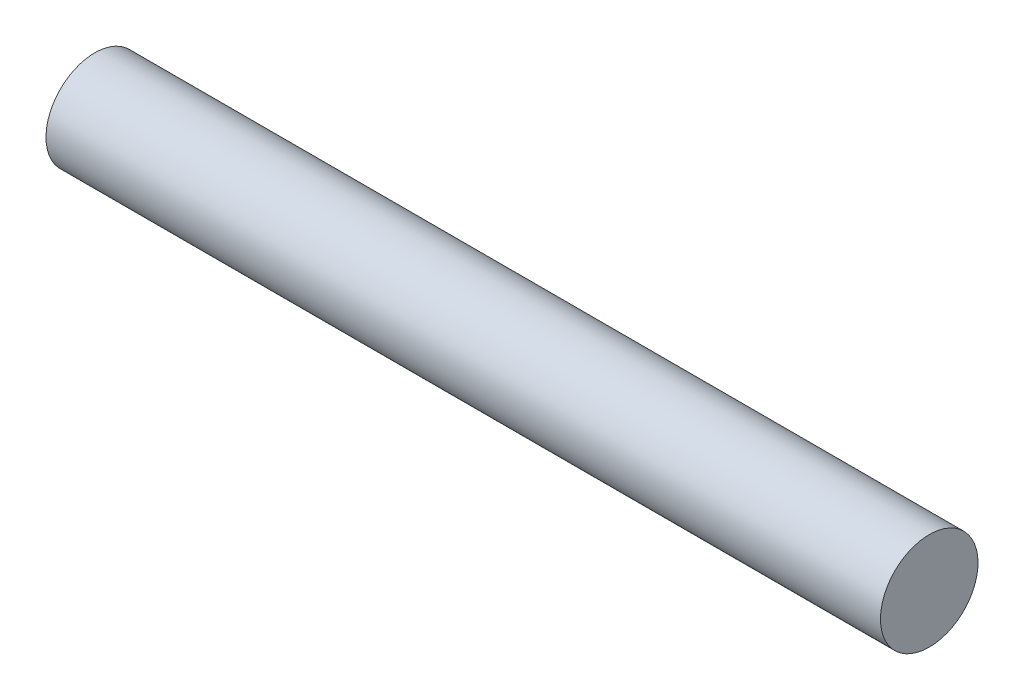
ISO-10303-21;
HEADER;
FILE_DESCRIPTION(('STEP AP214'),'2;1');
FILE_NAME('part.step','',(''),(''),'','','');
FILE_SCHEMA(('AUTOMOTIVE_DESIGN { 1 0 10303 214 1 1 1 1 }'));
ENDSEC;
DATA;
#1=APPLICATION_CONTEXT('core data for automotive mechanical design processes');
#2=APPLICATION_PROTOCOL_DEFINITION('international standard','automotive_design',2000,#1);
#3=PRODUCT_CONTEXT('',#1,'mechanical');
#4=PRODUCT('Part','Part','',(#3));
#5=PRODUCT_RELATED_PRODUCT_CATEGORY('part','',(#4));
#6=PRODUCT_DEFINITION_FORMATION('','',#4);
#7=PRODUCT_DEFINITION_CONTEXT('part definition',#1,'design');
#8=PRODUCT_DEFINITION('design','',#6,#7);
#9=PRODUCT_DEFINITION_SHAPE('','',#8);
#10=(LENGTH_UNIT() NAMED_UNIT(*) SI_UNIT(.MILLI.,.METRE.));
#11=(NAMED_UNIT(*) PLANE_ANGLE_UNIT() SI_UNIT($,.RADIAN.));
#12=(NAMED_UNIT(*) SI_UNIT($,.STERADIAN.) SOLID_ANGLE_UNIT());
#13=UNCERTAINTY_MEASURE_WITH_UNIT(LENGTH_MEASURE(1.E-05),#10,'distance_accuracy_value','');
#14=(GEOMETRIC_REPRESENTATION_CONTEXT(3) GLOBAL_UNCERTAINTY_ASSIGNED_CONTEXT((#13)) GLOBAL_UNIT_ASSIGNED_CONTEXT((#10,
#11,#12)) REPRESENTATION_CONTEXT('',''));
#15=CARTESIAN_POINT('',(0.,0.,0.));
#16=DIRECTION('',(0.,0.,1.));
#17=DIRECTION('',(1.,0.,0.));
#18=AXIS2_PLACEMENT_3D('',#15,#16,#17);
#19=CARTESIAN_POINT('',(0.,0.,0.));
#20=DIRECTION('',(1.,0.,0.));
#21=DIRECTION('',(0.,1.,0.));
#22=AXIS2_PLACEMENT_3D('',#19,#20,#21);
#23=PLANE('',#22);
#24=CARTESIAN_POINT('',(0.,0.,0.));
#25=DIRECTION('',(-1.,0.,0.));
#26=DIRECTION('',(0.,-1.,0.));
#27=AXIS2_PLACEMENT_3D('',#24,#25,#26);
#28=CIRCLE('',#27,3.37819999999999);
#29=CARTESIAN_POINT('',(0.,-3.37819999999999,0.));
#30=VERTEX_POINT('',#29);
#31=EDGE_CURVE('E10',#30,#30,#28,.T.);
#32=ORIENTED_EDGE('',*,*,#31,.T.);
#33=EDGE_LOOP('',(#32));
#34=FACE_BOUND('',#33,.T.);
#35=ADVANCED_FACE('F31',(#34),#23,.F.);
#36=CARTESIAN_POINT('',(57.785,0.,0.));
#37=DIRECTION('',(-1.,0.,0.));
#38=DIRECTION('',(0.,-1.,0.));
#39=AXIS2_PLACEMENT_3D('',#36,#37,#38);
#40=CYLINDRICAL_SURFACE('',#39,3.37819999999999);
#41=ORIENTED_EDGE('',*,*,#31,.F.);
#42=EDGE_LOOP('',(#41));
#43=FACE_BOUND('',#42,.T.);
#44=CARTESIAN_POINT('',(57.785,0.,0.));
#45=DIRECTION('',(-1.,0.,0.));
#46=DIRECTION('',(0.,-1.,0.));
#47=AXIS2_PLACEMENT_3D('',#44,#45,#46);
#48=CIRCLE('',#47,3.37819999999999);
#49=CARTESIAN_POINT('',(57.785,-3.37819999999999,0.));
#50=VERTEX_POINT('',#49);
#51=EDGE_CURVE('E37',#50,#50,#48,.T.);
#52=ORIENTED_EDGE('',*,*,#51,.T.);
#53=EDGE_LOOP('',(#52));
#54=FACE_BOUND('',#53,.T.);
#55=ADVANCED_FACE('F43',(#43,#54),#40,.T.);
#56=CARTESIAN_POINT('',(57.785,3.37819999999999,0.));
#57=DIRECTION('',(-1.,0.,0.));
#58=DIRECTION('',(0.,-1.,0.));
#59=AXIS2_PLACEMENT_3D('',#56,#57,#58);
#60=PLANE('',#59);
#61=ORIENTED_EDGE('',*,*,#51,.F.);
#62=EDGE_LOOP('',(#61));
#63=FACE_BOUND('',#62,.T.);
#64=ADVANCED_FACE('F45',(#63),#60,.F.);
#65=CLOSED_SHELL('',(#35,#55,#64));
#66=MANIFOLD_SOLID_BREP('B2',#65);
#67=ADVANCED_BREP_SHAPE_REPRESENTATION('',(#18,#66),#14);
#68=SHAPE_DEFINITION_REPRESENTATION(#9,#67);
ENDSEC;
END-ISO-10303-21;
